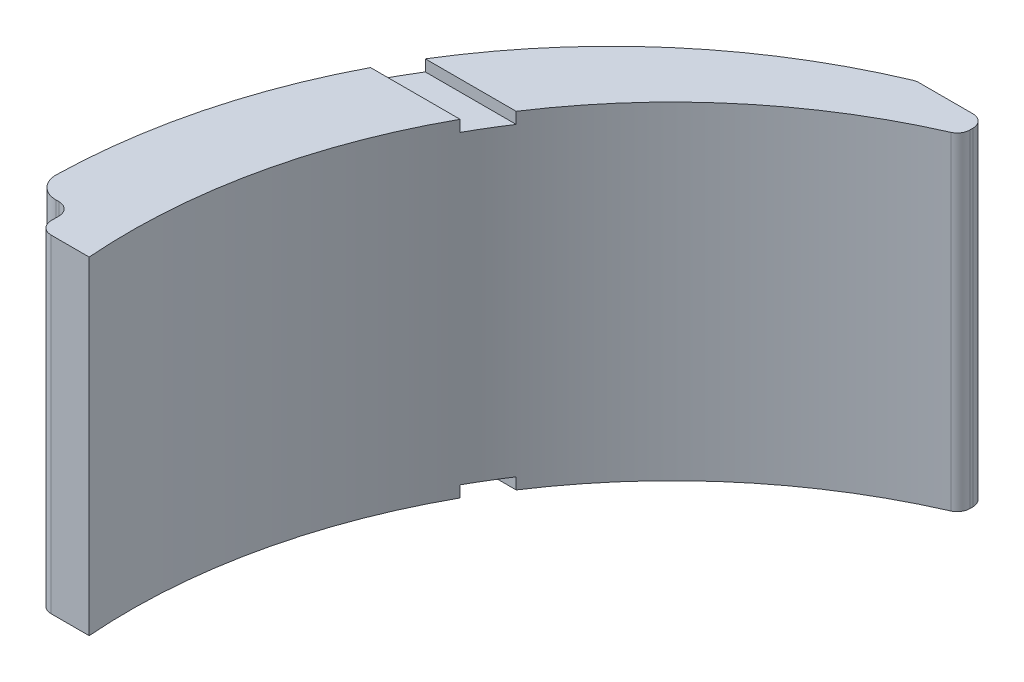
ISO-10303-21;
HEADER;
FILE_DESCRIPTION(('STEP AP214'),'2;1');
FILE_NAME('part.step','',(''),(''),'','','');
FILE_SCHEMA(('AUTOMOTIVE_DESIGN { 1 0 10303 214 1 1 1 1 }'));
ENDSEC;
DATA;
#1=APPLICATION_CONTEXT('core data for automotive mechanical design processes');
#2=APPLICATION_PROTOCOL_DEFINITION('international standard','automotive_design',2000,#1);
#3=PRODUCT_CONTEXT('',#1,'mechanical');
#4=PRODUCT('Part','Part','',(#3));
#5=PRODUCT_RELATED_PRODUCT_CATEGORY('part','',(#4));
#6=PRODUCT_DEFINITION_FORMATION('','',#4);
#7=PRODUCT_DEFINITION_CONTEXT('part definition',#1,'design');
#8=PRODUCT_DEFINITION('design','',#6,#7);
#9=PRODUCT_DEFINITION_SHAPE('','',#8);
#10=(LENGTH_UNIT() NAMED_UNIT(*) SI_UNIT(.MILLI.,.METRE.));
#11=(NAMED_UNIT(*) PLANE_ANGLE_UNIT() SI_UNIT($,.RADIAN.));
#12=(NAMED_UNIT(*) SI_UNIT($,.STERADIAN.) SOLID_ANGLE_UNIT());
#13=UNCERTAINTY_MEASURE_WITH_UNIT(LENGTH_MEASURE(1.E-05),#10,'distance_accuracy_value','');
#14=(GEOMETRIC_REPRESENTATION_CONTEXT(3) GLOBAL_UNCERTAINTY_ASSIGNED_CONTEXT((#13)) GLOBAL_UNIT_ASSIGNED_CONTEXT((#10,
#11,#12)) REPRESENTATION_CONTEXT('',''));
#15=CARTESIAN_POINT('',(0.,0.,0.));
#16=DIRECTION('',(0.,0.,1.));
#17=DIRECTION('',(1.,0.,0.));
#18=AXIS2_PLACEMENT_3D('',#15,#16,#17);
#19=CARTESIAN_POINT('',(127.978811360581,13.,-160.787304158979));
#20=DIRECTION('',(0.,1.,0.));
#21=DIRECTION('',(0.,0.,1.));
#22=AXIS2_PLACEMENT_3D('',#19,#20,#21);
#23=PLANE('',#22);
#24=DIRECTION('',(-1.,0.,0.));
#25=VECTOR('',#24,1.);
#26=CARTESIAN_POINT('',(117.387322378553,13.,-152.319736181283));
#27=LINE('',#26,#25);
#28=CARTESIAN_POINT('',(120.987839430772,13.,-152.319736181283));
#29=VERTEX_POINT('',#28);
#30=CARTESIAN_POINT('',(117.387322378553,13.,-152.319736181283));
#31=VERTEX_POINT('',#30);
#32=EDGE_CURVE('E190',#29,#31,#27,.T.);
#33=ORIENTED_EDGE('',*,*,#32,.F.);
#34=CARTESIAN_POINT('',(138.963623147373,13.,-140.524771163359));
#35=DIRECTION('',(0.,-1.,0.));
#36=DIRECTION('',(0.,0.,1.));
#37=AXIS2_PLACEMENT_3D('',#34,#35,#36);
#38=CIRCLE('',#37,21.5000000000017);
#39=CARTESIAN_POINT('',(130.323341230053,13.,-160.212217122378));
#40=VERTEX_POINT('',#39);
#41=EDGE_CURVE('E263',#29,#40,#38,.T.);
#42=ORIENTED_EDGE('',*,*,#41,.T.);
#43=CARTESIAN_POINT('',(130.122404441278,13.,-160.670064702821));
#44=DIRECTION('',(0.,1.,0.));
#45=DIRECTION('',(0.,0.,-1.));
#46=AXIS2_PLACEMENT_3D('',#43,#44,#45);
#47=CIRCLE('',#46,0.500000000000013);
#48=CARTESIAN_POINT('',(130.622404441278,13.,-160.670064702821));
#49=VERTEX_POINT('',#48);
#50=EDGE_CURVE('E267',#40,#49,#47,.T.);
#51=ORIENTED_EDGE('',*,*,#50,.T.);
#52=DIRECTION('',(0.,0.,-1.));
#53=VECTOR('',#52,1.);
#54=CARTESIAN_POINT('',(130.622404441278,13.,-160.787304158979));
#55=LINE('',#54,#53);
#56=CARTESIAN_POINT('',(130.622404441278,13.,-160.787304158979));
#57=VERTEX_POINT('',#56);
#58=EDGE_CURVE('E269',#49,#57,#55,.T.);
#59=ORIENTED_EDGE('',*,*,#58,.T.);
#60=CARTESIAN_POINT('',(130.122404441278,13.,-160.787304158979));
#61=DIRECTION('',(0.,1.,0.));
#62=DIRECTION('',(0.,0.,1.));
#63=AXIS2_PLACEMENT_3D('',#60,#61,#62);
#64=CIRCLE('',#63,0.500000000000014);
#65=CARTESIAN_POINT('',(130.122404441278,13.,-161.287304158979));
#66=VERTEX_POINT('',#65);
#67=EDGE_CURVE('E271',#57,#66,#64,.T.);
#68=ORIENTED_EDGE('',*,*,#67,.T.);
#69=DIRECTION('',(-1.,0.,0.));
#70=VECTOR('',#69,1.);
#71=CARTESIAN_POINT('',(127.978811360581,13.,-161.287304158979));
#72=LINE('',#71,#70);
#73=CARTESIAN_POINT('',(127.978811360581,13.,-161.287304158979));
#74=VERTEX_POINT('',#73);
#75=EDGE_CURVE('E273',#66,#74,#72,.T.);
#76=ORIENTED_EDGE('',*,*,#75,.T.);
#77=CARTESIAN_POINT('',(127.978811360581,13.,-160.787304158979));
#78=DIRECTION('',(0.,1.,0.));
#79=DIRECTION('',(0.,0.,1.));
#80=AXIS2_PLACEMENT_3D('',#77,#78,#79);
#81=CIRCLE('',#80,0.499999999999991);
#82=CARTESIAN_POINT('',(127.784058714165,13.,-161.247816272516));
#83=VERTEX_POINT('',#82);
#84=EDGE_CURVE('E244',#74,#83,#81,.T.);
#85=ORIENTED_EDGE('',*,*,#84,.T.);
#86=CARTESIAN_POINT('',(136.547927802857,13.,-140.524771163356));
#87=DIRECTION('',(0.,1.,0.));
#88=DIRECTION('',(0.,0.,1.));
#89=AXIS2_PLACEMENT_3D('',#86,#87,#88);
#90=CIRCLE('',#89,22.5);
#91=EDGE_CURVE('E249',#83,#31,#90,.T.);
#92=ORIENTED_EDGE('',*,*,#91,.T.);
#93=EDGE_LOOP('',(#33,#42,#51,#59,#68,#76,#85,#92));
#94=FACE_BOUND('',#93,.T.);
#95=ADVANCED_FACE('F41',(#94),#23,.T.);
#96=CARTESIAN_POINT('',(136.547927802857,13.,-140.524771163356));
#97=DIRECTION('',(0.,-1.,0.));
#98=DIRECTION('',(0.,0.,-1.));
#99=AXIS2_PLACEMENT_3D('',#96,#97,#98);
#100=CYLINDRICAL_SURFACE('',#99,22.5);
#101=CARTESIAN_POINT('',(136.547927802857,12.55,-140.524771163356));
#102=DIRECTION('',(0.,1.,0.));
#103=DIRECTION('',(0.,0.,1.));
#104=AXIS2_PLACEMENT_3D('',#101,#102,#103);
#105=CIRCLE('',#104,22.5);
#106=CARTESIAN_POINT('',(117.387322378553,12.55,-152.319736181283));
#107=VERTEX_POINT('',#106);
#108=CARTESIAN_POINT('',(116.600379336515,12.55,-150.933676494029));
#109=VERTEX_POINT('',#108);
#110=EDGE_CURVE('E200',#107,#109,#105,.T.);
#111=ORIENTED_EDGE('',*,*,#110,.F.);
#112=DIRECTION('',(0.,1.,0.));
#113=VECTOR('',#112,1.);
#114=CARTESIAN_POINT('',(117.387322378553,12.55,-152.319736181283));
#115=LINE('',#114,#113);
#116=EDGE_CURVE('E184',#107,#31,#115,.T.);
#117=ORIENTED_EDGE('',*,*,#116,.T.);
#118=ORIENTED_EDGE('',*,*,#91,.F.);
#119=DIRECTION('',(0.,-1.,0.));
#120=VECTOR('',#119,1.);
#121=CARTESIAN_POINT('',(127.784058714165,13.,-161.247816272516));
#122=LINE('',#121,#120);
#123=CARTESIAN_POINT('',(127.784058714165,0.,-161.247816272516));
#124=VERTEX_POINT('',#123);
#125=EDGE_CURVE('E11',#83,#124,#122,.T.);
#126=ORIENTED_EDGE('',*,*,#125,.T.);
#127=CARTESIAN_POINT('',(136.547927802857,0.,-140.524771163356));
#128=DIRECTION('',(0.,1.,0.));
#129=DIRECTION('',(0.,0.,1.));
#130=AXIS2_PLACEMENT_3D('',#127,#128,#129);
#131=CIRCLE('',#130,22.5);
#132=CARTESIAN_POINT('',(117.387322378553,0.,-152.319736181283));
#133=VERTEX_POINT('',#132);
#134=EDGE_CURVE('E279',#124,#133,#131,.T.);
#135=ORIENTED_EDGE('',*,*,#134,.T.);
#136=DIRECTION('',(0.,-1.,0.));
#137=VECTOR('',#136,1.);
#138=CARTESIAN_POINT('',(117.387322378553,0.45,-152.319736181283));
#139=LINE('',#138,#137);
#140=CARTESIAN_POINT('',(117.387322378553,0.45,-152.319736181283));
#141=VERTEX_POINT('',#140);
#142=EDGE_CURVE('E64',#141,#133,#139,.T.);
#143=ORIENTED_EDGE('',*,*,#142,.F.);
#144=CARTESIAN_POINT('',(136.547927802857,0.45,-140.524771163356));
#145=DIRECTION('',(0.,1.,0.));
#146=DIRECTION('',(0.,0.,1.));
#147=AXIS2_PLACEMENT_3D('',#144,#145,#146);
#148=CIRCLE('',#147,22.5);
#149=CARTESIAN_POINT('',(116.600379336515,0.45,-150.933676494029));
#150=VERTEX_POINT('',#149);
#151=EDGE_CURVE('E220',#141,#150,#148,.T.);
#152=ORIENTED_EDGE('',*,*,#151,.T.);
#153=DIRECTION('',(0.,-1.,0.));
#154=VECTOR('',#153,1.);
#155=CARTESIAN_POINT('',(116.600379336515,0.45,-150.933676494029));
#156=LINE('',#155,#154);
#157=CARTESIAN_POINT('',(116.600379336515,0.,-150.933676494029));
#158=VERTEX_POINT('',#157);
#159=EDGE_CURVE('E240',#150,#158,#156,.T.);
#160=ORIENTED_EDGE('',*,*,#159,.T.);
#161=CARTESIAN_POINT('',(114.053499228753,0.,-141.025453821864));
#162=VERTEX_POINT('',#161);
#163=EDGE_CURVE('E278',#158,#162,#131,.T.);
#164=ORIENTED_EDGE('',*,*,#163,.T.);
#165=DIRECTION('',(0.,-1.,0.));
#166=VECTOR('',#165,1.);
#167=CARTESIAN_POINT('',(114.053499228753,13.,-141.025453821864));
#168=LINE('',#167,#166);
#169=CARTESIAN_POINT('',(114.053499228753,13.,-141.025453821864));
#170=VERTEX_POINT('',#169);
#171=EDGE_CURVE('E49',#170,#162,#168,.T.);
#172=ORIENTED_EDGE('',*,*,#171,.F.);
#173=CARTESIAN_POINT('',(116.600379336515,13.,-150.933676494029));
#174=VERTEX_POINT('',#173);
#175=EDGE_CURVE('E247',#174,#170,#90,.T.);
#176=ORIENTED_EDGE('',*,*,#175,.F.);
#177=DIRECTION('',(0.,1.,0.));
#178=VECTOR('',#177,1.);
#179=CARTESIAN_POINT('',(116.600379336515,12.55,-150.933676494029));
#180=LINE('',#179,#178);
#181=EDGE_CURVE('E56',#109,#174,#180,.T.);
#182=ORIENTED_EDGE('',*,*,#181,.F.);
#183=EDGE_LOOP('',(#111,#117,#118,#126,#135,#143,#152,#160,#164,#172,#176,#182));
#184=FACE_BOUND('',#183,.T.);
#185=ADVANCED_FACE('F205',(#184),#100,.T.);
#186=CARTESIAN_POINT('',(138.963623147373,13.,-140.524771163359));
#187=DIRECTION('',(0.,-1.,0.));
#188=DIRECTION('',(0.,0.,-1.));
#189=AXIS2_PLACEMENT_3D('',#186,#187,#188);
#190=CYLINDRICAL_SURFACE('',#189,21.5000000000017);
#191=ORIENTED_EDGE('',*,*,#41,.F.);
#192=DIRECTION('',(0.,1.,0.));
#193=VECTOR('',#192,1.);
#194=CARTESIAN_POINT('',(120.987839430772,12.55,-152.319736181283));
#195=LINE('',#194,#193);
#196=CARTESIAN_POINT('',(120.987839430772,12.55,-152.319736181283));
#197=VERTEX_POINT('',#196);
#198=EDGE_CURVE('E195',#197,#29,#195,.T.);
#199=ORIENTED_EDGE('',*,*,#198,.F.);
#200=CARTESIAN_POINT('',(138.963623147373,12.55,-140.524771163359));
#201=DIRECTION('',(0.,-1.,0.));
#202=DIRECTION('',(0.,0.,1.));
#203=AXIS2_PLACEMENT_3D('',#200,#201,#202);
#204=CIRCLE('',#203,21.5000000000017);
#205=CARTESIAN_POINT('',(120.151268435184,12.55,-150.933676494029));
#206=VERTEX_POINT('',#205);
#207=EDGE_CURVE('E202',#206,#197,#204,.T.);
#208=ORIENTED_EDGE('',*,*,#207,.F.);
#209=DIRECTION('',(0.,1.,0.));
#210=VECTOR('',#209,1.);
#211=CARTESIAN_POINT('',(120.151268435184,12.55,-150.933676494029));
#212=LINE('',#211,#210);
#213=CARTESIAN_POINT('',(120.151268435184,13.,-150.933676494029));
#214=VERTEX_POINT('',#213);
#215=EDGE_CURVE('E216',#206,#214,#212,.T.);
#216=ORIENTED_EDGE('',*,*,#215,.T.);
#217=CARTESIAN_POINT('',(117.528724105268,13.,-138.852914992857));
#218=VERTEX_POINT('',#217);
#219=EDGE_CURVE('E264',#218,#214,#38,.T.);
#220=ORIENTED_EDGE('',*,*,#219,.F.);
#221=DIRECTION('',(0.,-1.,0.));
#222=VECTOR('',#221,1.);
#223=CARTESIAN_POINT('',(117.528724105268,13.,-138.852914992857));
#224=LINE('',#223,#222);
#225=CARTESIAN_POINT('',(117.528724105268,0.,-138.852914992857));
#226=VERTEX_POINT('',#225);
#227=EDGE_CURVE('E319',#218,#226,#224,.T.);
#228=ORIENTED_EDGE('',*,*,#227,.T.);
#229=CARTESIAN_POINT('',(138.963623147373,0.,-140.524771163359));
#230=DIRECTION('',(0.,-1.,0.));
#231=DIRECTION('',(0.,0.,1.));
#232=AXIS2_PLACEMENT_3D('',#229,#230,#231);
#233=CIRCLE('',#232,21.5000000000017);
#234=CARTESIAN_POINT('',(120.151268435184,0.,-150.933676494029));
#235=VERTEX_POINT('',#234);
#236=EDGE_CURVE('E295',#226,#235,#233,.T.);
#237=ORIENTED_EDGE('',*,*,#236,.T.);
#238=DIRECTION('',(0.,-1.,0.));
#239=VECTOR('',#238,1.);
#240=CARTESIAN_POINT('',(120.151268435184,0.45,-150.933676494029));
#241=LINE('',#240,#239);
#242=CARTESIAN_POINT('',(120.151268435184,0.45,-150.933676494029));
#243=VERTEX_POINT('',#242);
#244=EDGE_CURVE('E238',#243,#235,#241,.T.);
#245=ORIENTED_EDGE('',*,*,#244,.F.);
#246=CARTESIAN_POINT('',(138.963623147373,0.45,-140.524771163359));
#247=DIRECTION('',(0.,-1.,0.));
#248=DIRECTION('',(0.,0.,1.));
#249=AXIS2_PLACEMENT_3D('',#246,#247,#248);
#250=CIRCLE('',#249,21.5000000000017);
#251=CARTESIAN_POINT('',(120.987839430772,0.45,-152.319736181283));
#252=VERTEX_POINT('',#251);
#253=EDGE_CURVE('E226',#243,#252,#250,.T.);
#254=ORIENTED_EDGE('',*,*,#253,.T.);
#255=DIRECTION('',(0.,-1.,0.));
#256=VECTOR('',#255,1.);
#257=CARTESIAN_POINT('',(120.987839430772,0.45,-152.319736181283));
#258=LINE('',#257,#256);
#259=CARTESIAN_POINT('',(120.987839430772,0.,-152.319736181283));
#260=VERTEX_POINT('',#259);
#261=EDGE_CURVE('E235',#252,#260,#258,.T.);
#262=ORIENTED_EDGE('',*,*,#261,.T.);
#263=CARTESIAN_POINT('',(130.323341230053,0.,-160.212217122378));
#264=VERTEX_POINT('',#263);
#265=EDGE_CURVE('E294',#260,#264,#233,.T.);
#266=ORIENTED_EDGE('',*,*,#265,.T.);
#267=DIRECTION('',(0.,-1.,0.));
#268=VECTOR('',#267,1.);
#269=CARTESIAN_POINT('',(130.323341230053,13.,-160.212217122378));
#270=LINE('',#269,#268);
#271=EDGE_CURVE('E316',#40,#264,#270,.T.);
#272=ORIENTED_EDGE('',*,*,#271,.F.);
#273=EDGE_LOOP('',(#191,#199,#208,#216,#220,#228,#237,#245,#254,#262,#266,#272));
#274=FACE_BOUND('',#273,.T.);
#275=ADVANCED_FACE('F365',(#274),#190,.F.);
#276=CARTESIAN_POINT('',(127.978811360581,0.,-160.787304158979));
#277=DIRECTION('',(0.,1.,0.));
#278=DIRECTION('',(0.,0.,1.));
#279=AXIS2_PLACEMENT_3D('',#276,#277,#278);
#280=PLANE('',#279);
#281=DIRECTION('',(1.,0.,0.));
#282=VECTOR('',#281,1.);
#283=CARTESIAN_POINT('',(116.600379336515,0.,-150.933676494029));
#284=LINE('',#283,#282);
#285=EDGE_CURVE('E194',#158,#235,#284,.T.);
#286=ORIENTED_EDGE('',*,*,#285,.T.);
#287=ORIENTED_EDGE('',*,*,#236,.F.);
#288=DIRECTION('',(1.,0.,0.));
#289=VECTOR('',#288,1.);
#290=CARTESIAN_POINT('',(117.528724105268,0.,-138.852914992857));
#291=LINE('',#290,#289);
#292=CARTESIAN_POINT('',(116.02343053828,0.,-138.852914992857));
#293=VERTEX_POINT('',#292);
#294=EDGE_CURVE('E292',#293,#226,#291,.T.);
#295=ORIENTED_EDGE('',*,*,#294,.F.);
#296=CARTESIAN_POINT('',(116.02343053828,0.,-139.352914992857));
#297=DIRECTION('',(0.,1.,0.));
#298=DIRECTION('',(0.,0.,-1.));
#299=AXIS2_PLACEMENT_3D('',#296,#297,#298);
#300=CIRCLE('',#299,0.500000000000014);
#301=CARTESIAN_POINT('',(115.52343053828,0.,-139.352914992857));
#302=VERTEX_POINT('',#301);
#303=EDGE_CURVE('E290',#302,#293,#300,.T.);
#304=ORIENTED_EDGE('',*,*,#303,.F.);
#305=DIRECTION('',(0.,0.,1.));
#306=VECTOR('',#305,1.);
#307=CARTESIAN_POINT('',(115.52343053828,0.,-139.656539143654));
#308=LINE('',#307,#306);
#309=CARTESIAN_POINT('',(115.52343053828,0.,-139.656539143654));
#310=VERTEX_POINT('',#309);
#311=EDGE_CURVE('E288',#310,#302,#308,.T.);
#312=ORIENTED_EDGE('',*,*,#311,.F.);
#313=CARTESIAN_POINT('',(115.02343053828,0.,-139.656539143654));
#314=DIRECTION('',(0.,-1.,0.));
#315=DIRECTION('',(0.,0.,1.));
#316=AXIS2_PLACEMENT_3D('',#313,#314,#315);
#317=CIRCLE('',#316,0.5);
#318=CARTESIAN_POINT('',(115.02343053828,0.,-140.156539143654));
#319=VERTEX_POINT('',#318);
#320=EDGE_CURVE('E286',#319,#310,#317,.T.);
#321=ORIENTED_EDGE('',*,*,#320,.F.);
#322=DIRECTION('',(1.,0.,0.));
#323=VECTOR('',#322,1.);
#324=CARTESIAN_POINT('',(114.903288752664,0.,-140.156539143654));
#325=LINE('',#324,#323);
#326=CARTESIAN_POINT('',(114.903288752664,0.,-140.156539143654));
#327=VERTEX_POINT('',#326);
#328=EDGE_CURVE('E284',#327,#319,#325,.T.);
#329=ORIENTED_EDGE('',*,*,#328,.F.);
#330=CARTESIAN_POINT('',(114.903288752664,0.,-141.006539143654));
#331=DIRECTION('',(0.,1.,0.));
#332=DIRECTION('',(0.,0.,1.));
#333=AXIS2_PLACEMENT_3D('',#330,#331,#332);
#334=CIRCLE('',#333,0.849999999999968);
#335=EDGE_CURVE('E282',#162,#327,#334,.T.);
#336=ORIENTED_EDGE('',*,*,#335,.F.);
#337=ORIENTED_EDGE('',*,*,#163,.F.);
#338=EDGE_LOOP('',(#286,#287,#295,#304,#312,#321,#329,#336,#337));
#339=FACE_BOUND('',#338,.T.);
#340=ADVANCED_FACE('F346',(#339),#280,.F.);
#341=DIRECTION('',(-1.,0.,0.));
#342=VECTOR('',#341,1.);
#343=CARTESIAN_POINT('',(117.387322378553,0.,-152.319736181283));
#344=LINE('',#343,#342);
#345=EDGE_CURVE('E224',#260,#133,#344,.T.);
#346=ORIENTED_EDGE('',*,*,#345,.T.);
#347=ORIENTED_EDGE('',*,*,#134,.F.);
#348=CARTESIAN_POINT('',(127.978811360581,0.,-160.787304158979));
#349=DIRECTION('',(0.,1.,0.));
#350=DIRECTION('',(0.,0.,1.));
#351=AXIS2_PLACEMENT_3D('',#348,#349,#350);
#352=CIRCLE('',#351,0.499999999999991);
#353=CARTESIAN_POINT('',(127.978811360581,0.,-161.287304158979));
#354=VERTEX_POINT('',#353);
#355=EDGE_CURVE('E243',#354,#124,#352,.T.);
#356=ORIENTED_EDGE('',*,*,#355,.F.);
#357=DIRECTION('',(-1.,0.,0.));
#358=VECTOR('',#357,1.);
#359=CARTESIAN_POINT('',(127.978811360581,0.,-161.287304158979));
#360=LINE('',#359,#358);
#361=CARTESIAN_POINT('',(130.122404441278,0.,-161.287304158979));
#362=VERTEX_POINT('',#361);
#363=EDGE_CURVE('E248',#362,#354,#360,.T.);
#364=ORIENTED_EDGE('',*,*,#363,.F.);
#365=CARTESIAN_POINT('',(130.122404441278,0.,-160.787304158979));
#366=DIRECTION('',(0.,1.,0.));
#367=DIRECTION('',(0.,0.,1.));
#368=AXIS2_PLACEMENT_3D('',#365,#366,#367);
#369=CIRCLE('',#368,0.500000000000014);
#370=CARTESIAN_POINT('',(130.622404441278,0.,-160.787304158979));
#371=VERTEX_POINT('',#370);
#372=EDGE_CURVE('E302',#371,#362,#369,.T.);
#373=ORIENTED_EDGE('',*,*,#372,.F.);
#374=DIRECTION('',(0.,0.,-1.));
#375=VECTOR('',#374,1.);
#376=CARTESIAN_POINT('',(130.622404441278,0.,-160.787304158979));
#377=LINE('',#376,#375);
#378=CARTESIAN_POINT('',(130.622404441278,0.,-160.670064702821));
#379=VERTEX_POINT('',#378);
#380=EDGE_CURVE('E300',#379,#371,#377,.T.);
#381=ORIENTED_EDGE('',*,*,#380,.F.);
#382=CARTESIAN_POINT('',(130.122404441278,0.,-160.670064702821));
#383=DIRECTION('',(0.,1.,0.));
#384=DIRECTION('',(0.,0.,-1.));
#385=AXIS2_PLACEMENT_3D('',#382,#383,#384);
#386=CIRCLE('',#385,0.500000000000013);
#387=EDGE_CURVE('E298',#264,#379,#386,.T.);
#388=ORIENTED_EDGE('',*,*,#387,.F.);
#389=ORIENTED_EDGE('',*,*,#265,.F.);
#390=EDGE_LOOP('',(#346,#347,#356,#364,#373,#381,#388,#389));
#391=FACE_BOUND('',#390,.T.);
#392=ADVANCED_FACE('F375',(#391),#280,.F.);
#393=CARTESIAN_POINT('',(127.978811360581,13.,-160.787304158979));
#394=DIRECTION('',(0.,-1.,0.));
#395=DIRECTION('',(0.,0.,-1.));
#396=AXIS2_PLACEMENT_3D('',#393,#394,#395);
#397=CYLINDRICAL_SURFACE('',#396,0.499999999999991);
#398=ORIENTED_EDGE('',*,*,#355,.T.);
#399=ORIENTED_EDGE('',*,*,#125,.F.);
#400=ORIENTED_EDGE('',*,*,#84,.F.);
#401=DIRECTION('',(0.,-1.,0.));
#402=VECTOR('',#401,1.);
#403=CARTESIAN_POINT('',(127.978811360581,13.,-161.287304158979));
#404=LINE('',#403,#402);
#405=EDGE_CURVE('E275',#74,#354,#404,.T.);
#406=ORIENTED_EDGE('',*,*,#405,.T.);
#407=EDGE_LOOP('',(#398,#399,#400,#406));
#408=FACE_BOUND('',#407,.T.);
#409=ADVANCED_FACE('F43',(#408),#397,.T.);
#410=CARTESIAN_POINT('',(114.903288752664,13.,-141.006539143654));
#411=DIRECTION('',(0.,-1.,0.));
#412=DIRECTION('',(0.,0.,-1.));
#413=AXIS2_PLACEMENT_3D('',#410,#411,#412);
#414=CYLINDRICAL_SURFACE('',#413,0.849999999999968);
#415=ORIENTED_EDGE('',*,*,#335,.T.);
#416=DIRECTION('',(0.,-1.,0.));
#417=VECTOR('',#416,1.);
#418=CARTESIAN_POINT('',(114.903288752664,13.,-140.156539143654));
#419=LINE('',#418,#417);
#420=CARTESIAN_POINT('',(114.903288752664,13.,-140.156539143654));
#421=VERTEX_POINT('',#420);
#422=EDGE_CURVE('E334',#421,#327,#419,.T.);
#423=ORIENTED_EDGE('',*,*,#422,.F.);
#424=CARTESIAN_POINT('',(114.903288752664,13.,-141.006539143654));
#425=DIRECTION('',(0.,1.,0.));
#426=DIRECTION('',(0.,0.,1.));
#427=AXIS2_PLACEMENT_3D('',#424,#425,#426);
#428=CIRCLE('',#427,0.849999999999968);
#429=EDGE_CURVE('E251',#170,#421,#428,.T.);
#430=ORIENTED_EDGE('',*,*,#429,.F.);
#431=ORIENTED_EDGE('',*,*,#171,.T.);
#432=EDGE_LOOP('',(#415,#423,#430,#431));
#433=FACE_BOUND('',#432,.T.);
#434=ADVANCED_FACE('F341',(#433),#414,.T.);
#435=CARTESIAN_POINT('',(114.903288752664,13.,-140.156539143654));
#436=DIRECTION('',(0.,0.,-1.));
#437=DIRECTION('',(-1.,0.,0.));
#438=AXIS2_PLACEMENT_3D('',#435,#436,#437);
#439=PLANE('',#438);
#440=ORIENTED_EDGE('',*,*,#328,.T.);
#441=DIRECTION('',(0.,-1.,0.));
#442=VECTOR('',#441,1.);
#443=CARTESIAN_POINT('',(115.02343053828,13.,-140.156539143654));
#444=LINE('',#443,#442);
#445=CARTESIAN_POINT('',(115.02343053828,13.,-140.156539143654));
#446=VERTEX_POINT('',#445);
#447=EDGE_CURVE('E331',#446,#319,#444,.T.);
#448=ORIENTED_EDGE('',*,*,#447,.F.);
#449=DIRECTION('',(1.,0.,0.));
#450=VECTOR('',#449,1.);
#451=CARTESIAN_POINT('',(114.903288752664,13.,-140.156539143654));
#452=LINE('',#451,#450);
#453=EDGE_CURVE('E253',#421,#446,#452,.T.);
#454=ORIENTED_EDGE('',*,*,#453,.F.);
#455=ORIENTED_EDGE('',*,*,#422,.T.);
#456=EDGE_LOOP('',(#440,#448,#454,#455));
#457=FACE_BOUND('',#456,.T.);
#458=ADVANCED_FACE('F351',(#457),#439,.F.);
#459=CARTESIAN_POINT('',(115.02343053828,13.,-139.656539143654));
#460=DIRECTION('',(0.,-1.,0.));
#461=DIRECTION('',(0.,0.,-1.));
#462=AXIS2_PLACEMENT_3D('',#459,#460,#461);
#463=CYLINDRICAL_SURFACE('',#462,0.5);
#464=ORIENTED_EDGE('',*,*,#320,.T.);
#465=DIRECTION('',(0.,-1.,0.));
#466=VECTOR('',#465,1.);
#467=CARTESIAN_POINT('',(115.52343053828,13.,-139.656539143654));
#468=LINE('',#467,#466);
#469=CARTESIAN_POINT('',(115.52343053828,13.,-139.656539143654));
#470=VERTEX_POINT('',#469);
#471=EDGE_CURVE('E328',#470,#310,#468,.T.);
#472=ORIENTED_EDGE('',*,*,#471,.F.);
#473=CARTESIAN_POINT('',(115.02343053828,13.,-139.656539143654));
#474=DIRECTION('',(0.,-1.,0.));
#475=DIRECTION('',(0.,0.,1.));
#476=AXIS2_PLACEMENT_3D('',#473,#474,#475);
#477=CIRCLE('',#476,0.5);
#478=EDGE_CURVE('E255',#446,#470,#477,.T.);
#479=ORIENTED_EDGE('',*,*,#478,.F.);
#480=ORIENTED_EDGE('',*,*,#447,.T.);
#481=EDGE_LOOP('',(#464,#472,#479,#480));
#482=FACE_BOUND('',#481,.T.);
#483=ADVANCED_FACE('F355',(#482),#463,.F.);
#484=CARTESIAN_POINT('',(115.52343053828,13.,-139.656539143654));
#485=DIRECTION('',(1.,0.,0.));
#486=DIRECTION('',(0.,0.,-1.));
#487=AXIS2_PLACEMENT_3D('',#484,#485,#486);
#488=PLANE('',#487);
#489=ORIENTED_EDGE('',*,*,#311,.T.);
#490=DIRECTION('',(0.,-1.,0.));
#491=VECTOR('',#490,1.);
#492=CARTESIAN_POINT('',(115.52343053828,13.,-139.352914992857));
#493=LINE('',#492,#491);
#494=CARTESIAN_POINT('',(115.52343053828,13.,-139.352914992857));
#495=VERTEX_POINT('',#494);
#496=EDGE_CURVE('E325',#495,#302,#493,.T.);
#497=ORIENTED_EDGE('',*,*,#496,.F.);
#498=DIRECTION('',(0.,0.,1.));
#499=VECTOR('',#498,1.);
#500=CARTESIAN_POINT('',(115.52343053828,13.,-139.656539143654));
#501=LINE('',#500,#499);
#502=EDGE_CURVE('E257',#470,#495,#501,.T.);
#503=ORIENTED_EDGE('',*,*,#502,.F.);
#504=ORIENTED_EDGE('',*,*,#471,.T.);
#505=EDGE_LOOP('',(#489,#497,#503,#504));
#506=FACE_BOUND('',#505,.T.);
#507=ADVANCED_FACE('F401',(#506),#488,.F.);
#508=CARTESIAN_POINT('',(116.02343053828,13.,-139.352914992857));
#509=DIRECTION('',(0.,-1.,0.));
#510=DIRECTION('',(0.,0.,-1.));
#511=AXIS2_PLACEMENT_3D('',#508,#509,#510);
#512=CYLINDRICAL_SURFACE('',#511,0.500000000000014);
#513=ORIENTED_EDGE('',*,*,#303,.T.);
#514=DIRECTION('',(0.,-1.,0.));
#515=VECTOR('',#514,1.);
#516=CARTESIAN_POINT('',(116.02343053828,13.,-138.852914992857));
#517=LINE('',#516,#515);
#518=CARTESIAN_POINT('',(116.02343053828,13.,-138.852914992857));
#519=VERTEX_POINT('',#518);
#520=EDGE_CURVE('E322',#519,#293,#517,.T.);
#521=ORIENTED_EDGE('',*,*,#520,.F.);
#522=CARTESIAN_POINT('',(116.02343053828,13.,-139.352914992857));
#523=DIRECTION('',(0.,1.,0.));
#524=DIRECTION('',(0.,0.,-1.));
#525=AXIS2_PLACEMENT_3D('',#522,#523,#524);
#526=CIRCLE('',#525,0.500000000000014);
#527=EDGE_CURVE('E259',#495,#519,#526,.T.);
#528=ORIENTED_EDGE('',*,*,#527,.F.);
#529=ORIENTED_EDGE('',*,*,#496,.T.);
#530=EDGE_LOOP('',(#513,#521,#528,#529));
#531=FACE_BOUND('',#530,.T.);
#532=ADVANCED_FACE('F398',(#531),#512,.T.);
#533=CARTESIAN_POINT('',(117.528724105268,13.,-138.852914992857));
#534=DIRECTION('',(0.,0.,-1.));
#535=DIRECTION('',(-1.,0.,0.));
#536=AXIS2_PLACEMENT_3D('',#533,#534,#535);
#537=PLANE('',#536);
#538=ORIENTED_EDGE('',*,*,#294,.T.);
#539=ORIENTED_EDGE('',*,*,#227,.F.);
#540=DIRECTION('',(1.,0.,0.));
#541=VECTOR('',#540,1.);
#542=CARTESIAN_POINT('',(117.528724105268,13.,-138.852914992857));
#543=LINE('',#542,#541);
#544=EDGE_CURVE('E261',#519,#218,#543,.T.);
#545=ORIENTED_EDGE('',*,*,#544,.F.);
#546=ORIENTED_EDGE('',*,*,#520,.T.);
#547=EDGE_LOOP('',(#538,#539,#545,#546));
#548=FACE_BOUND('',#547,.T.);
#549=ADVANCED_FACE('F394',(#548),#537,.F.);
#550=CARTESIAN_POINT('',(130.122404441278,13.,-160.670064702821));
#551=DIRECTION('',(0.,-1.,0.));
#552=DIRECTION('',(0.,0.,-1.));
#553=AXIS2_PLACEMENT_3D('',#550,#551,#552);
#554=CYLINDRICAL_SURFACE('',#553,0.500000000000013);
#555=ORIENTED_EDGE('',*,*,#387,.T.);
#556=DIRECTION('',(0.,-1.,0.));
#557=VECTOR('',#556,1.);
#558=CARTESIAN_POINT('',(130.622404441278,13.,-160.670064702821));
#559=LINE('',#558,#557);
#560=EDGE_CURVE('E313',#49,#379,#559,.T.);
#561=ORIENTED_EDGE('',*,*,#560,.F.);
#562=ORIENTED_EDGE('',*,*,#50,.F.);
#563=ORIENTED_EDGE('',*,*,#271,.T.);
#564=EDGE_LOOP('',(#555,#561,#562,#563));
#565=FACE_BOUND('',#564,.T.);
#566=ADVANCED_FACE('F439',(#565),#554,.T.);
#567=CARTESIAN_POINT('',(130.622404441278,13.,-160.787304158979));
#568=DIRECTION('',(-1.,0.,0.));
#569=DIRECTION('',(0.,0.,1.));
#570=AXIS2_PLACEMENT_3D('',#567,#568,#569);
#571=PLANE('',#570);
#572=ORIENTED_EDGE('',*,*,#380,.T.);
#573=DIRECTION('',(0.,-1.,0.));
#574=VECTOR('',#573,1.);
#575=CARTESIAN_POINT('',(130.622404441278,13.,-160.787304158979));
#576=LINE('',#575,#574);
#577=EDGE_CURVE('E310',#57,#371,#576,.T.);
#578=ORIENTED_EDGE('',*,*,#577,.F.);
#579=ORIENTED_EDGE('',*,*,#58,.F.);
#580=ORIENTED_EDGE('',*,*,#560,.T.);
#581=EDGE_LOOP('',(#572,#578,#579,#580));
#582=FACE_BOUND('',#581,.T.);
#583=ADVANCED_FACE('F433',(#582),#571,.F.);
#584=CARTESIAN_POINT('',(130.122404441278,13.,-160.787304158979));
#585=DIRECTION('',(0.,-1.,0.));
#586=DIRECTION('',(0.,0.,-1.));
#587=AXIS2_PLACEMENT_3D('',#584,#585,#586);
#588=CYLINDRICAL_SURFACE('',#587,0.500000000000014);
#589=ORIENTED_EDGE('',*,*,#372,.T.);
#590=DIRECTION('',(0.,-1.,0.));
#591=VECTOR('',#590,1.);
#592=CARTESIAN_POINT('',(130.122404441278,13.,-161.287304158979));
#593=LINE('',#592,#591);
#594=EDGE_CURVE('E307',#66,#362,#593,.T.);
#595=ORIENTED_EDGE('',*,*,#594,.F.);
#596=ORIENTED_EDGE('',*,*,#67,.F.);
#597=ORIENTED_EDGE('',*,*,#577,.T.);
#598=EDGE_LOOP('',(#589,#595,#596,#597));
#599=FACE_BOUND('',#598,.T.);
#600=ADVANCED_FACE('F426',(#599),#588,.T.);
#601=CARTESIAN_POINT('',(127.978811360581,13.,-161.287304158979));
#602=DIRECTION('',(0.,0.,1.));
#603=DIRECTION('',(1.,0.,0.));
#604=AXIS2_PLACEMENT_3D('',#601,#602,#603);
#605=PLANE('',#604);
#606=ORIENTED_EDGE('',*,*,#363,.T.);
#607=ORIENTED_EDGE('',*,*,#405,.F.);
#608=ORIENTED_EDGE('',*,*,#75,.F.);
#609=ORIENTED_EDGE('',*,*,#594,.T.);
#610=EDGE_LOOP('',(#606,#607,#608,#609));
#611=FACE_BOUND('',#610,.T.);
#612=ADVANCED_FACE('F419',(#611),#605,.F.);
#613=DIRECTION('',(1.,0.,0.));
#614=VECTOR('',#613,1.);
#615=CARTESIAN_POINT('',(116.600379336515,13.,-150.933676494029));
#616=LINE('',#615,#614);
#617=EDGE_CURVE('E207',#174,#214,#616,.T.);
#618=ORIENTED_EDGE('',*,*,#617,.F.);
#619=ORIENTED_EDGE('',*,*,#175,.T.);
#620=ORIENTED_EDGE('',*,*,#429,.T.);
#621=ORIENTED_EDGE('',*,*,#453,.T.);
#622=ORIENTED_EDGE('',*,*,#478,.T.);
#623=ORIENTED_EDGE('',*,*,#502,.T.);
#624=ORIENTED_EDGE('',*,*,#527,.T.);
#625=ORIENTED_EDGE('',*,*,#544,.T.);
#626=ORIENTED_EDGE('',*,*,#219,.T.);
#627=EDGE_LOOP('',(#618,#619,#620,#621,#622,#623,#624,#625,#626));
#628=FACE_BOUND('',#627,.T.);
#629=ADVANCED_FACE('F359',(#628),#23,.T.);
#630=CARTESIAN_POINT('',(116.600379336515,0.45,-150.933676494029));
#631=DIRECTION('',(0.,0.,-1.));
#632=DIRECTION('',(-1.,0.,0.));
#633=AXIS2_PLACEMENT_3D('',#630,#631,#632);
#634=PLANE('',#633);
#635=ORIENTED_EDGE('',*,*,#285,.F.);
#636=ORIENTED_EDGE('',*,*,#159,.F.);
#637=DIRECTION('',(1.,0.,0.));
#638=VECTOR('',#637,1.);
#639=CARTESIAN_POINT('',(116.600379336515,0.45,-150.933676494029));
#640=LINE('',#639,#638);
#641=EDGE_CURVE('E223',#150,#243,#640,.T.);
#642=ORIENTED_EDGE('',*,*,#641,.T.);
#643=ORIENTED_EDGE('',*,*,#244,.T.);
#644=EDGE_LOOP('',(#635,#636,#642,#643));
#645=FACE_BOUND('',#644,.T.);
#646=ADVANCED_FACE('F388',(#645),#634,.T.);
#647=CARTESIAN_POINT('',(117.387322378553,0.45,-152.319736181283));
#648=DIRECTION('',(0.,0.,1.));
#649=DIRECTION('',(1.,0.,0.));
#650=AXIS2_PLACEMENT_3D('',#647,#648,#649);
#651=PLANE('',#650);
#652=ORIENTED_EDGE('',*,*,#345,.F.);
#653=ORIENTED_EDGE('',*,*,#261,.F.);
#654=DIRECTION('',(-1.,0.,0.));
#655=VECTOR('',#654,1.);
#656=CARTESIAN_POINT('',(117.387322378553,0.45,-152.319736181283));
#657=LINE('',#656,#655);
#658=EDGE_CURVE('E229',#252,#141,#657,.T.);
#659=ORIENTED_EDGE('',*,*,#658,.T.);
#660=ORIENTED_EDGE('',*,*,#142,.T.);
#661=EDGE_LOOP('',(#652,#653,#659,#660));
#662=FACE_BOUND('',#661,.T.);
#663=ADVANCED_FACE('F379',(#662),#651,.T.);
#664=CARTESIAN_POINT('',(136.547927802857,0.45,-140.524771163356));
#665=DIRECTION('',(0.,1.,0.));
#666=DIRECTION('',(0.,0.,1.));
#667=AXIS2_PLACEMENT_3D('',#664,#665,#666);
#668=PLANE('',#667);
#669=ORIENTED_EDGE('',*,*,#151,.F.);
#670=ORIENTED_EDGE('',*,*,#658,.F.);
#671=ORIENTED_EDGE('',*,*,#253,.F.);
#672=ORIENTED_EDGE('',*,*,#641,.F.);
#673=EDGE_LOOP('',(#669,#670,#671,#672));
#674=FACE_BOUND('',#673,.T.);
#675=ADVANCED_FACE('F385',(#674),#668,.F.);
#676=CARTESIAN_POINT('',(117.387322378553,12.55,-152.319736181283));
#677=DIRECTION('',(0.,0.,-1.));
#678=DIRECTION('',(-1.,0.,0.));
#679=AXIS2_PLACEMENT_3D('',#676,#677,#678);
#680=PLANE('',#679);
#681=ORIENTED_EDGE('',*,*,#32,.T.);
#682=ORIENTED_EDGE('',*,*,#116,.F.);
#683=DIRECTION('',(-1.,0.,0.));
#684=VECTOR('',#683,1.);
#685=CARTESIAN_POINT('',(117.387322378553,12.55,-152.319736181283));
#686=LINE('',#685,#684);
#687=EDGE_CURVE('E187',#197,#107,#686,.T.);
#688=ORIENTED_EDGE('',*,*,#687,.F.);
#689=ORIENTED_EDGE('',*,*,#198,.T.);
#690=EDGE_LOOP('',(#681,#682,#688,#689));
#691=FACE_BOUND('',#690,.T.);
#692=ADVANCED_FACE('F186',(#691),#680,.F.);
#693=CARTESIAN_POINT('',(116.600379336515,12.55,-150.933676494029));
#694=DIRECTION('',(0.,0.,1.));
#695=DIRECTION('',(1.,0.,0.));
#696=AXIS2_PLACEMENT_3D('',#693,#694,#695);
#697=PLANE('',#696);
#698=ORIENTED_EDGE('',*,*,#617,.T.);
#699=ORIENTED_EDGE('',*,*,#215,.F.);
#700=DIRECTION('',(1.,0.,0.));
#701=VECTOR('',#700,1.);
#702=CARTESIAN_POINT('',(116.600379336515,12.55,-150.933676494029));
#703=LINE('',#702,#701);
#704=EDGE_CURVE('E212',#109,#206,#703,.T.);
#705=ORIENTED_EDGE('',*,*,#704,.F.);
#706=ORIENTED_EDGE('',*,*,#181,.T.);
#707=EDGE_LOOP('',(#698,#699,#705,#706));
#708=FACE_BOUND('',#707,.T.);
#709=ADVANCED_FACE('F362',(#708),#697,.F.);
#710=CARTESIAN_POINT('',(136.547927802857,12.55,-140.524771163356));
#711=DIRECTION('',(0.,-1.,0.));
#712=DIRECTION('',(0.,0.,1.));
#713=AXIS2_PLACEMENT_3D('',#710,#711,#712);
#714=PLANE('',#713);
#715=ORIENTED_EDGE('',*,*,#110,.T.);
#716=ORIENTED_EDGE('',*,*,#704,.T.);
#717=ORIENTED_EDGE('',*,*,#207,.T.);
#718=ORIENTED_EDGE('',*,*,#687,.T.);
#719=EDGE_LOOP('',(#715,#716,#717,#718));
#720=FACE_BOUND('',#719,.T.);
#721=ADVANCED_FACE('F198',(#720),#714,.F.);
#722=CLOSED_SHELL('',(#95,#185,#275,#340,#392,#409,#434,#458,#483,#507,#532,#549,#566,#583,#600,
#612,#629,#646,#663,#675,#692,#709,#721));
#723=MANIFOLD_SOLID_BREP('B2',#722);
#724=ADVANCED_BREP_SHAPE_REPRESENTATION('',(#18,#723),#14);
#725=SHAPE_DEFINITION_REPRESENTATION(#9,#724);
ENDSEC;
END-ISO-10303-21;
